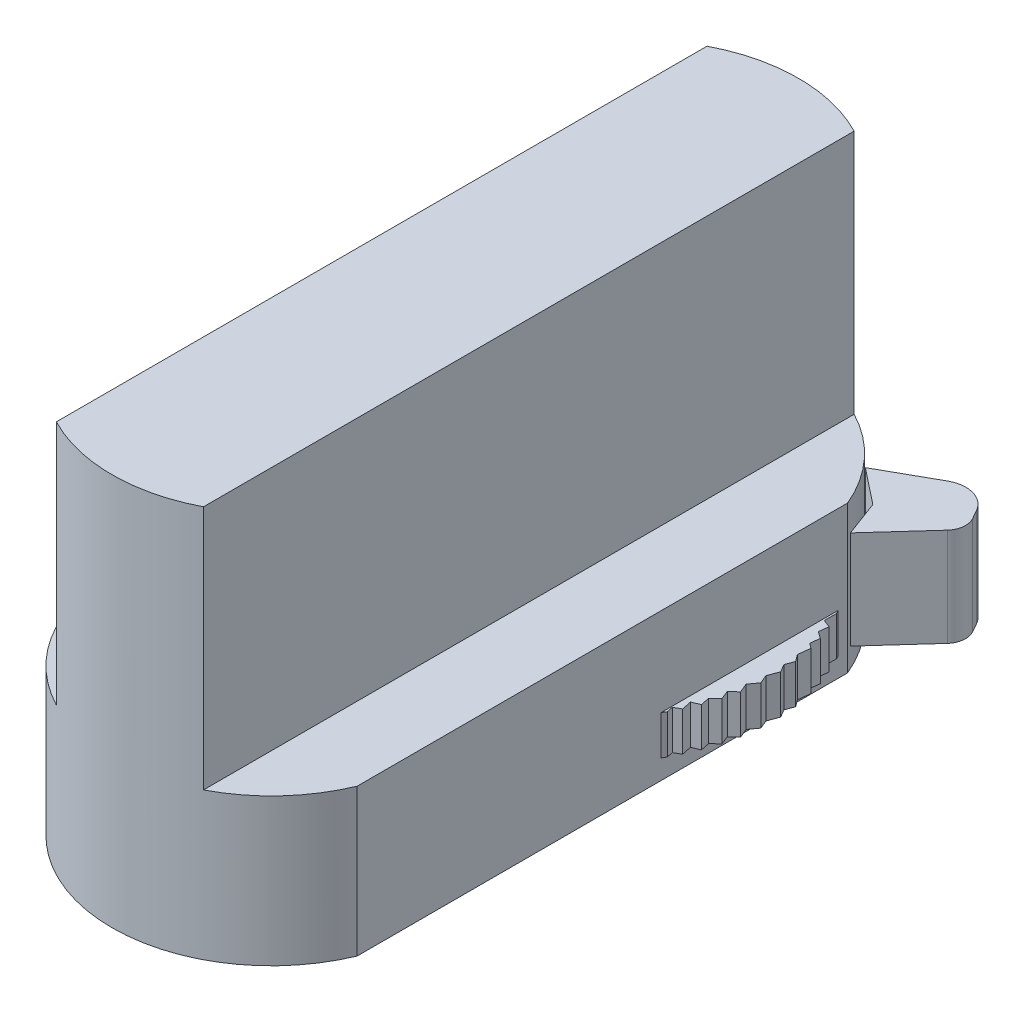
from build123d import *

# Parameters (mm, degrees)
DODANIE_WYCI_GNI_CIE1_DEPTH      = 35
DODANIE_WYCI_GNI_CIE1_DEPTH_BACK = 35
WYTNIJ_WYCI_GNI_CIE1_DEPTH       = 48
SZKIC3_R                         = 6
WYTNIJ_WYCI_GNI_CIE2_DEPTH       = 3
DODANIE_WYCI_GNI_CIE2_DEPTH      = 4
DODANIE_WYCI_GNI_CIE3_DEPTH      = 10


with BuildPart() as part:
    # Szkic1 → Dodanie-wyci_gni_cie1 (new, two sides: drawn at the far end of the back side and taken through both)
    with BuildSketch(Plane.XY.offset(-DODANIE_WYCI_GNI_CIE1_DEPTH_BACK)):
        Polygon((-7.5, 20), (7.5, 20), (7.5, -5), (15, -5), (15, -20), (-15, -20), (-15, -5), (-7.5, -5), align=None)
    extrude(amount=DODANIE_WYCI_GNI_CIE1_DEPTH + DODANIE_WYCI_GNI_CIE1_DEPTH_BACK)

    # Szkic2 → Wytnij-wyci_gni_cie1 (cut)
    with BuildSketch(Plane(origin=(0, 20, 0), x_dir=(1, 0, 0), z_dir=(0, 1, 0))):
        with BuildLine():
            Line((-15, 25), (-19.651712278, 25))
            Line((-19.651712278, 25), (-19.651712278, 39.743951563))
            Line((-19.651712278, 39.743951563), (23.952457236, 39.743951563))
            Line((23.952457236, 39.743951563), (22.96519302, 23.371819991))
            Line((22.96519302, 23.371819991), (15, 25))
            ThreePointArc((15, 25), (0, 35), (-15, 25))
        make_face()
        with BuildLine():
            Line((23.952457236, -39.743951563), (22.96519302, -23.371819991))
            Line((22.96519302, -23.371819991), (15, -25))
            ThreePointArc((15, -25), (0, -35), (-15, -25))
            Line((-15, -25), (-19.651712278, -25))
            Line((-19.651712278, -25), (-19.651712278, -39.743951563))
            Line((-19.651712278, -39.743951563), (23.952457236, -39.743951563))
        make_face()
    extrude(amount=-WYTNIJ_WYCI_GNI_CIE1_DEPTH, mode=Mode.SUBTRACT)

    # Szkic3 → Wytnij-wyci_gni_cie2 (cut)
    with BuildSketch(Plane.XZ.offset(20)):
        with Locations(Location((0, 18, 0), (0, 0, 270))):
            Circle(SZKIC3_R)
    extrude(amount=-WYTNIJ_WYCI_GNI_CIE2_DEPTH, mode=Mode.SUBTRACT)

    # Szkic4 → Dodanie-wyci_gni_cie2 (add)
    with BuildSketch(Plane(origin=(0, -18, 0), x_dir=(-1, 0, 0), z_dir=(0, -1, 0))):
        with BuildLine():
            Line((-15.186689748, 23.695657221), (-15.186689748, 22.430111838))
            Line((-15.186689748, 22.430111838), (-15.977599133, 22.139070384))
            Line((-15.977599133, 22.139070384), (-15.863803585, 21.156170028))
            Line((-15.863803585, 21.156170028), (-16.563603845, 20.647745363))
            Line((-16.563603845, 20.647745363), (-16.45124437, 19.67724898))
            Line((-16.45124437, 19.67724898), (-16.961907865, 19.306237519))
            Line((-16.961907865, 19.306237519), (-16.818355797, 18.066317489))
            Line((-16.818355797, 18.066317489), (-17.339776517, 17.362657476))
            Line((-17.339776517, 17.362657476), (-17.019097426, 16.491207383))
            Line((-17.019097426, 16.491207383), (-17.486507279, 15.687068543))
            Line((-17.486507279, 15.687068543), (-17.082344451, 14.588750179))
            Line((-17.082344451, 14.588750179), (-17.45183592, 13.702532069))
            Line((-17.45183592, 13.702532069), (-16.818355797, 12.830604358))
            Line((-16.818355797, 12.830604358), (-17.218131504, 11.87175009))
            Line((-17.218131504, 11.87175009), (-16.507424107, 11.228046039))
            Line((-16.507424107, 11.228046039), (-16.862777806, 10.320606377))
            Line((-16.862777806, 10.320606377), (-16.152233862, 9.67705037))
            Line((-16.152233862, 9.67705037), (-16.345597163, 8.74928377))
            Line((-16.345597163, 8.74928377), (-15.56137486, 8.422317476))
            Line((-15.56137486, 8.422317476), (-15.771157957, 7.41576789))
            Line((-15.771157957, 7.41576789), (-15.101327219, 7.026425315))
            Line((-15.101327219, 7.026425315), (-15.23435936, 6.388130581))
            ThreePointArc((-15.23435936, 6.388130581), (0, -2.5), (15.23435936, 6.388130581))
            Line((15.23435936, 6.388130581), (15.101327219, 7.026425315))
            Line((15.101327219, 7.026425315), (15.771157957, 7.41576789))
            Line((15.771157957, 7.41576789), (15.56137486, 8.422317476))
            Line((15.56137486, 8.422317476), (16.345597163, 8.74928377))
            Line((16.345597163, 8.74928377), (16.152233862, 9.67705037))
            Line((16.152233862, 9.67705037), (16.862777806, 10.320606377))
            Line((16.862777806, 10.320606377), (16.507424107, 11.228046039))
            Line((16.507424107, 11.228046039), (17.218131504, 11.87175009))
            Line((17.218131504, 11.87175009), (16.818355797, 12.830604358))
            Line((16.818355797, 12.830604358), (17.45183592, 13.702532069))
            Line((17.45183592, 13.702532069), (17.082344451, 14.588750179))
            Line((17.082344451, 14.588750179), (17.486507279, 15.687068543))
            Line((17.486507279, 15.687068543), (17.019097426, 16.491207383))
            Line((17.019097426, 16.491207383), (17.339776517, 17.362657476))
            Line((17.339776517, 17.362657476), (16.818355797, 18.066317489))
            Line((16.818355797, 18.066317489), (16.961907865, 19.306237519))
            Line((16.961907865, 19.306237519), (16.45124437, 19.67724898))
            Line((16.45124437, 19.67724898), (16.563603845, 20.647745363))
            Line((16.563603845, 20.647745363), (15.863803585, 21.156170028))
            Line((15.863803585, 21.156170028), (15.977599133, 22.139070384))
            Line((15.977599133, 22.139070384), (15.186689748, 22.430111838))
            Line((15.186689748, 22.430111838), (15.186689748, 23.695657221))
            ThreePointArc((15.186689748, 23.695657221), (0, 32.5), (-15.186689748, 23.695657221))
        make_face()
    extrude(amount=-DODANIE_WYCI_GNI_CIE2_DEPTH)


with BuildPart() as body_2:
    # Szkic5 → Dodanie-wyci_gni_cie3 (new body)
    with BuildSketch(Plane(origin=(0, -18, 0), x_dir=(-1, 0, 0), z_dir=(0, -1, 0))):
        with BuildLine():
            Line((-9.784062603, 32.029344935), (-15.162104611, 35.041975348))
            ThreePointArc((-15.162104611, 35.041975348), (-17.442259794, 35.31210547), (-19.245583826, 33.890803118))
            Line((-19.245583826, 33.890803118), (-19.740788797, 33.006780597))
            ThreePointArc((-19.740788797, 33.006780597), (-19.983186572, 31.804151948), (-19.477833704, 30.686256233))
            Line((-19.477833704, 30.686256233), (-14.780313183, 25.503135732))
            Line((-14.780313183, 25.503135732), (-13.420849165, 29.150747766))
            Line((-13.420849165, 29.150747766), (-9.784062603, 32.029344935))
        make_face()
    extrude(amount=-DODANIE_WYCI_GNI_CIE3_DEPTH)


solid = Compound([part.part, body_2.part])
